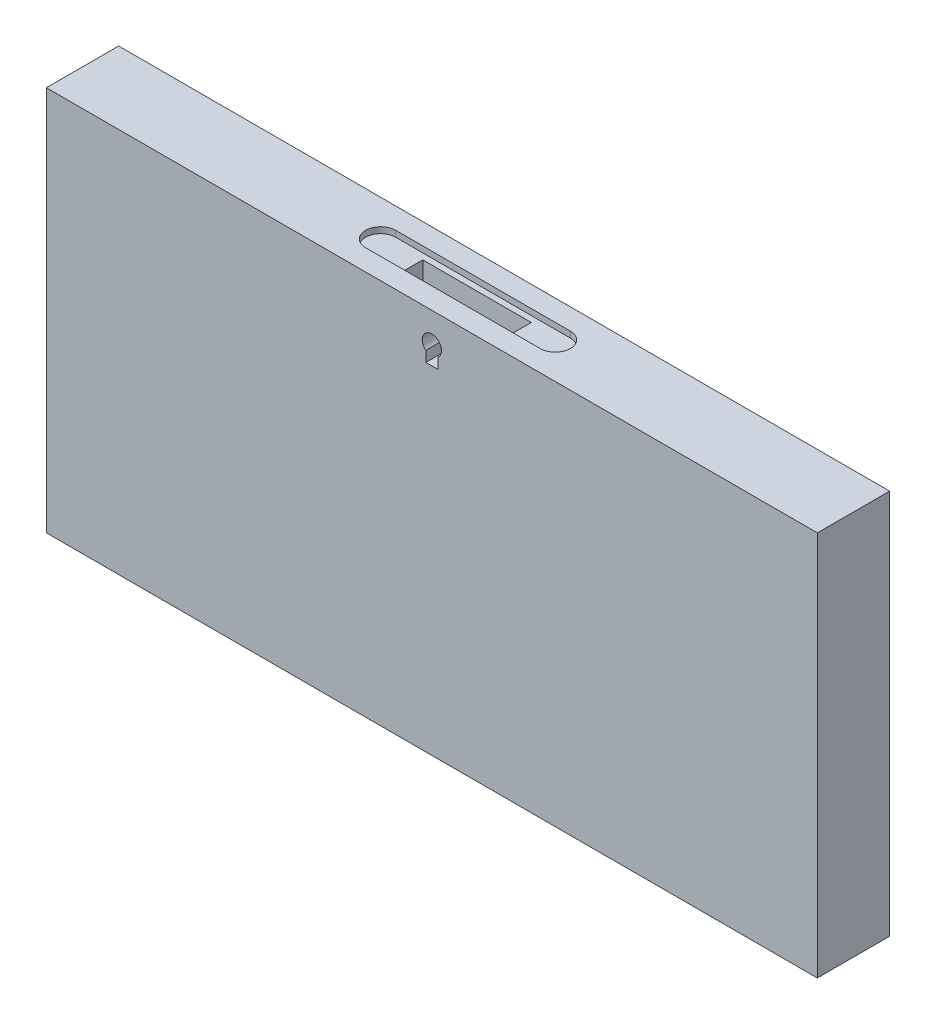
from build123d import *

# Parameters (mm, degrees)
SKETCH1_W          = 203.2
SKETCH1_H          = 19.05
EXTRUDE1_DEPTH     = 101.6
CUT_EXTRUDE1_DEPTH = 1.5875
SKETCH3_W          = 28.575
SKETCH3_H          = 4.7625
CUT_EXTRUDE2_DEPTH = 15.875
CUT_EXTRUDE3_REACH = 229.982


with BuildPart() as part:
    # Sketch1 → Extrude1 (new body)
    with BuildSketch(Plane(origin=(0, 0, 0), x_dir=(1, 0, 0), z_dir=(0, 1, 0))):
        with Locations((101.6, 9.525)):
            Rectangle(SKETCH1_W, SKETCH1_H)
    extrude(amount=-EXTRUDE1_DEPTH)

    # Sketch2 → Cut-Extrude1 (cut)
    with BuildSketch(Plane(origin=(0, 0, 0), x_dir=(1, 0, 0), z_dir=(0, 1, 0))):
        with BuildLine():
            Line((78.58125, 5.55625), (124.61875, 5.55625))
            ThreePointArc((124.61875, 5.55625), (128.5875, 9.525), (124.61875, 13.49375))
            Line((124.61875, 13.49375), (78.58125, 13.49375))
            ThreePointArc((78.58125, 13.49375), (74.6125, 9.525), (78.58125, 5.55625))
        make_face()
    extrude(amount=-CUT_EXTRUDE1_DEPTH, mode=Mode.SUBTRACT)

    # Sketch3 → Cut-Extrude2 (cut)
    with BuildSketch(Plane(origin=(0, -1.5875, 0), x_dir=(1, 0, 0), z_dir=(0, 1, 0))):
        with Locations((101.6, 9.525)):
            Rectangle(SKETCH3_W, SKETCH3_H)
    extrude(amount=-CUT_EXTRUDE2_DEPTH, mode=Mode.SUBTRACT)

    # Sketch4 → Cut-Extrude3 (cut, up to next)
    with BuildSketch(Plane.XY, mode=Mode.PRIVATE) as cut_extrude3_sk1:
        with BuildLine():
            Line((100.0125, -9.920286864), (100.0125, -12.7))
            Line((100.0125, -12.7), (103.1875, -12.7))
            Line((103.1875, -12.7), (103.1875, -9.920286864))
            ThreePointArc((103.1875, -9.920286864), (101.6, -5.3975), (100.0125, -9.920286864))
        make_face()
    cut_extrude3_tool1 = extrude(cut_extrude3_sk1.sketch, amount=-CUT_EXTRUDE3_REACH, mode=Mode.PRIVATE) & part.part
    add(cut_extrude3_tool1.solids().sort_by_distance((101.6, -8.90926, 0))[0], mode=Mode.SUBTRACT)


solid = part.part
